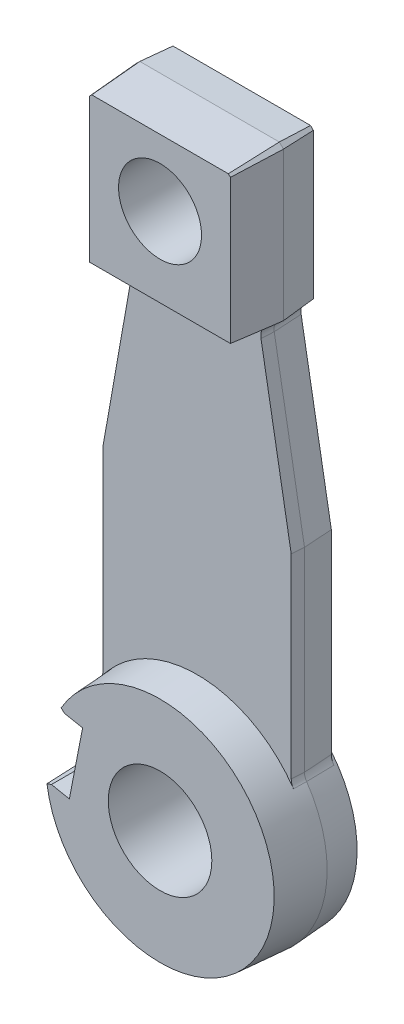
ISO-10303-21;
HEADER;
FILE_DESCRIPTION(('STEP AP214'),'2;1');
FILE_NAME('part.step','',(''),(''),'','','');
FILE_SCHEMA(('AUTOMOTIVE_DESIGN { 1 0 10303 214 1 1 1 1 }'));
ENDSEC;
DATA;
#1=APPLICATION_CONTEXT('core data for automotive mechanical design processes');
#2=APPLICATION_PROTOCOL_DEFINITION('international standard','automotive_design',2000,#1);
#3=PRODUCT_CONTEXT('',#1,'mechanical');
#4=PRODUCT('Part','Part','',(#3));
#5=PRODUCT_RELATED_PRODUCT_CATEGORY('part','',(#4));
#6=PRODUCT_DEFINITION_FORMATION('','',#4);
#7=PRODUCT_DEFINITION_CONTEXT('part definition',#1,'design');
#8=PRODUCT_DEFINITION('design','',#6,#7);
#9=PRODUCT_DEFINITION_SHAPE('','',#8);
#10=(LENGTH_UNIT() NAMED_UNIT(*) SI_UNIT(.MILLI.,.METRE.));
#11=(NAMED_UNIT(*) PLANE_ANGLE_UNIT() SI_UNIT($,.RADIAN.));
#12=(NAMED_UNIT(*) SI_UNIT($,.STERADIAN.) SOLID_ANGLE_UNIT());
#13=UNCERTAINTY_MEASURE_WITH_UNIT(LENGTH_MEASURE(1.E-05),#10,'distance_accuracy_value','');
#14=(GEOMETRIC_REPRESENTATION_CONTEXT(3) GLOBAL_UNCERTAINTY_ASSIGNED_CONTEXT((#13)) GLOBAL_UNIT_ASSIGNED_CONTEXT((#10,
#11,#12)) REPRESENTATION_CONTEXT('',''));
#15=CARTESIAN_POINT('',(0.,0.,0.));
#16=DIRECTION('',(0.,0.,1.));
#17=DIRECTION('',(1.,0.,0.));
#18=AXIS2_PLACEMENT_3D('',#15,#16,#17);
#19=CARTESIAN_POINT('',(-26.,17.7834192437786,-7.));
#20=DIRECTION('',(0.,0.,1.));
#21=DIRECTION('',(1.,0.,0.));
#22=AXIS2_PLACEMENT_3D('',#19,#20,#21);
#23=PLANE('',#22);
#24=DIRECTION('',(-1.,0.,0.));
#25=VECTOR('',#24,1.);
#26=CARTESIAN_POINT('',(-17.4105123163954,110.360258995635,-7.));
#27=LINE('',#26,#25);
#28=CARTESIAN_POINT('',(17.4105123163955,110.360258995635,-7.));
#29=VERTEX_POINT('',#28);
#30=CARTESIAN_POINT('',(-17.4105123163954,110.360258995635,-7.));
#31=VERTEX_POINT('',#30);
#32=EDGE_CURVE('E339',#29,#31,#27,.T.);
#33=ORIENTED_EDGE('',*,*,#32,.F.);
#34=CARTESIAN_POINT('',(18.6248728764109,107.08889036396,-7.));
#35=DIRECTION('',(0.,0.,1.));
#36=DIRECTION('',(1.,0.,0.));
#37=AXIS2_PLACEMENT_3D('',#34,#35,#36);
#38=CIRCLE('',#37,3.48948768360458);
#39=CARTESIAN_POINT('',(15.1883983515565,106.482947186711,-7.));
#40=VERTEX_POINT('',#39);
#41=EDGE_CURVE('E646',#40,#29,#38,.F.);
#42=ORIENTED_EDGE('',*,*,#41,.F.);
#43=DIRECTION('',(-0.173648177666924,0.984807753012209,0.));
#44=VECTOR('',#43,1.);
#45=CARTESIAN_POINT('',(29.1149288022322,27.501668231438,-7.));
#46=LINE('',#45,#44);
#47=CARTESIAN_POINT('',(22.5105123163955,64.9571753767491,-7.));
#48=VERTEX_POINT('',#47);
#49=EDGE_CURVE('E644',#48,#40,#46,.T.);
#50=ORIENTED_EDGE('',*,*,#49,.F.);
#51=DIRECTION('',(0.,1.,0.));
#52=VECTOR('',#51,1.);
#53=CARTESIAN_POINT('',(22.5105123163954,17.7834192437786,-7.));
#54=LINE('',#53,#52);
#55=CARTESIAN_POINT('',(22.5105123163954,17.7834192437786,-7.));
#56=VERTEX_POINT('',#55);
#57=EDGE_CURVE('E309',#56,#48,#54,.T.);
#58=ORIENTED_EDGE('',*,*,#57,.F.);
#59=CARTESIAN_POINT('',(26.,17.7834192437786,-7.));
#60=DIRECTION('',(0.,0.,1.));
#61=DIRECTION('',(1.,0.,0.));
#62=AXIS2_PLACEMENT_3D('',#59,#60,#61);
#63=CIRCLE('',#62,3.48948768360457);
#64=CARTESIAN_POINT('',(23.1197879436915,15.8134185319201,-7.));
#65=VERTEX_POINT('',#64);
#66=EDGE_CURVE('E306',#65,#56,#63,.F.);
#67=ORIENTED_EDGE('',*,*,#66,.F.);
#68=CARTESIAN_POINT('',(0.,0.,-7.));
#69=DIRECTION('',(0.,0.,-1.));
#70=DIRECTION('',(-1.,0.,0.));
#71=AXIS2_PLACEMENT_3D('',#68,#69,#70);
#72=CIRCLE('',#71,28.0105123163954);
#73=CARTESIAN_POINT('',(-23.1197879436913,15.8134185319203,-7.));
#74=VERTEX_POINT('',#73);
#75=EDGE_CURVE('E80',#74,#65,#72,.T.);
#76=ORIENTED_EDGE('',*,*,#75,.F.);
#77=CARTESIAN_POINT('',(-26.,17.7834192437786,-7.));
#78=DIRECTION('',(0.,0.,1.));
#79=DIRECTION('',(1.,0.,0.));
#80=AXIS2_PLACEMENT_3D('',#77,#78,#79);
#81=CIRCLE('',#80,3.48948768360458);
#82=CARTESIAN_POINT('',(-22.5105123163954,17.7834192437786,-7.));
#83=VERTEX_POINT('',#82);
#84=EDGE_CURVE('E310',#83,#74,#81,.F.);
#85=ORIENTED_EDGE('',*,*,#84,.F.);
#86=DIRECTION('',(0.,-1.,0.));
#87=VECTOR('',#86,1.);
#88=CARTESIAN_POINT('',(-22.5105123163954,17.7834192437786,-7.));
#89=LINE('',#88,#87);
#90=CARTESIAN_POINT('',(-22.5105123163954,64.9571753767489,-7.));
#91=VERTEX_POINT('',#90);
#92=EDGE_CURVE('E314',#91,#83,#89,.T.);
#93=ORIENTED_EDGE('',*,*,#92,.F.);
#94=DIRECTION('',(-0.173648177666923,-0.984807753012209,0.));
#95=VECTOR('',#94,1.);
#96=CARTESIAN_POINT('',(-30.6829206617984,18.6091445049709,-7.));
#97=LINE('',#96,#95);
#98=CARTESIAN_POINT('',(-15.1883983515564,106.482947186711,-7.));
#99=VERTEX_POINT('',#98);
#100=EDGE_CURVE('E653',#99,#91,#97,.T.);
#101=ORIENTED_EDGE('',*,*,#100,.F.);
#102=CARTESIAN_POINT('',(-18.6248728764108,107.08889036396,-7.));
#103=DIRECTION('',(0.,0.,1.));
#104=DIRECTION('',(1.,0.,0.));
#105=AXIS2_PLACEMENT_3D('',#102,#103,#104);
#106=CIRCLE('',#105,3.48948768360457);
#107=EDGE_CURVE('E651',#31,#99,#106,.F.);
#108=ORIENTED_EDGE('',*,*,#107,.F.);
#109=EDGE_LOOP('',(#33,#42,#50,#58,#67,#76,#85,#93,#101,#108));
#110=FACE_BOUND('',#109,.T.);
#111=ADVANCED_FACE('F31',(#110),#23,.F.);
#112=CARTESIAN_POINT('',(-26.,17.7834192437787,3.));
#113=DIRECTION('',(0.,0.,1.));
#114=DIRECTION('',(1.,0.,0.));
#115=AXIS2_PLACEMENT_3D('',#112,#113,#114);
#116=PLANE('',#115);
#117=CARTESIAN_POINT('',(18.6248728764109,107.08889036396,3.));
#118=DIRECTION('',(0.,0.,1.));
#119=DIRECTION('',(1.,0.,0.));
#120=AXIS2_PLACEMENT_3D('',#117,#118,#119);
#121=CIRCLE('',#120,3.20978043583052);
#122=CARTESIAN_POINT('',(15.4638562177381,106.531517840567,3.));
#123=VERTEX_POINT('',#122);
#124=CARTESIAN_POINT('',(17.6902195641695,110.159576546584,3.));
#125=VERTEX_POINT('',#124);
#126=EDGE_CURVE('E609',#123,#125,#121,.F.);
#127=ORIENTED_EDGE('',*,*,#126,.T.);
#128=DIRECTION('',(1.,0.,0.));
#129=VECTOR('',#128,1.);
#130=CARTESIAN_POINT('',(17.6902195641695,110.159576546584,3.));
#131=LINE('',#130,#129);
#132=CARTESIAN_POINT('',(-17.6902195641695,110.159576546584,3.));
#133=VERTEX_POINT('',#132);
#134=EDGE_CURVE('E283',#133,#125,#131,.T.);
#135=ORIENTED_EDGE('',*,*,#134,.F.);
#136=CARTESIAN_POINT('',(-18.6248728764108,107.08889036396,3.));
#137=DIRECTION('',(0.,0.,1.));
#138=DIRECTION('',(1.,0.,0.));
#139=AXIS2_PLACEMENT_3D('',#136,#137,#138);
#140=CIRCLE('',#139,3.20978043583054);
#141=CARTESIAN_POINT('',(-15.463856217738,106.531517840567,3.));
#142=VERTEX_POINT('',#141);
#143=EDGE_CURVE('E611',#133,#142,#140,.F.);
#144=ORIENTED_EDGE('',*,*,#143,.T.);
#145=DIRECTION('',(0.173648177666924,0.984807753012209,0.));
#146=VECTOR('',#145,1.);
#147=CARTESIAN_POINT('',(-15.463856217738,106.531517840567,3.));
#148=LINE('',#147,#146);
#149=CARTESIAN_POINT('',(-22.7902195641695,64.9816465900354,3.));
#150=VERTEX_POINT('',#149);
#151=EDGE_CURVE('E598',#142,#150,#148,.F.);
#152=ORIENTED_EDGE('',*,*,#151,.T.);
#153=DIRECTION('',(0.,1.,0.));
#154=VECTOR('',#153,1.);
#155=CARTESIAN_POINT('',(-22.7902195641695,65.0000000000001,3.));
#156=LINE('',#155,#154);
#157=CARTESIAN_POINT('',(-22.7902195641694,17.7834192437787,3.));
#158=VERTEX_POINT('',#157);
#159=EDGE_CURVE('E601',#150,#158,#156,.F.);
#160=ORIENTED_EDGE('',*,*,#159,.T.);
#161=CARTESIAN_POINT('',(-26.,17.7834192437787,3.));
#162=DIRECTION('',(0.,0.,1.));
#163=DIRECTION('',(1.,0.,0.));
#164=AXIS2_PLACEMENT_3D('',#161,#162,#163);
#165=CIRCLE('',#164,3.20978043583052);
#166=CARTESIAN_POINT('',(-23.3506574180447,15.9713280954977,3.));
#167=VERTEX_POINT('',#166);
#168=EDGE_CURVE('E604',#158,#167,#165,.F.);
#169=ORIENTED_EDGE('',*,*,#168,.T.);
#170=CARTESIAN_POINT('',(0.,0.,3.));
#171=DIRECTION('',(0.,0.,1.));
#172=DIRECTION('',(1.,0.,0.));
#173=AXIS2_PLACEMENT_3D('',#170,#171,#172);
#174=CIRCLE('',#173,28.2902195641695);
#175=CARTESIAN_POINT('',(23.3506574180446,15.9713280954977,3.));
#176=VERTEX_POINT('',#175);
#177=EDGE_CURVE('E663',#176,#167,#174,.T.);
#178=ORIENTED_EDGE('',*,*,#177,.F.);
#179=CARTESIAN_POINT('',(26.0000000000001,17.7834192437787,3.));
#180=DIRECTION('',(0.,0.,1.));
#181=DIRECTION('',(1.,0.,0.));
#182=AXIS2_PLACEMENT_3D('',#179,#180,#181);
#183=CIRCLE('',#182,3.20978043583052);
#184=CARTESIAN_POINT('',(22.7902195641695,17.7834192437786,3.));
#185=VERTEX_POINT('',#184);
#186=EDGE_CURVE('E607',#176,#185,#183,.F.);
#187=ORIENTED_EDGE('',*,*,#186,.T.);
#188=DIRECTION('',(0.,-1.,0.));
#189=VECTOR('',#188,1.);
#190=CARTESIAN_POINT('',(22.7902195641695,17.7834192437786,3.));
#191=LINE('',#190,#189);
#192=CARTESIAN_POINT('',(22.7902195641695,64.9816465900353,3.));
#193=VERTEX_POINT('',#192);
#194=EDGE_CURVE('E605',#185,#193,#191,.F.);
#195=ORIENTED_EDGE('',*,*,#194,.T.);
#196=DIRECTION('',(0.173648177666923,-0.984807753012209,0.));
#197=VECTOR('',#196,1.);
#198=CARTESIAN_POINT('',(22.7934066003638,64.9635720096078,3.));
#199=LINE('',#198,#197);
#200=EDGE_CURVE('E589',#193,#123,#199,.F.);
#201=ORIENTED_EDGE('',*,*,#200,.T.);
#202=EDGE_LOOP('',(#127,#135,#144,#152,#160,#169,#178,#187,#195,#201));
#203=FACE_BOUND('',#202,.T.);
#204=ADVANCED_FACE('F423',(#203),#116,.T.);
#205=CARTESIAN_POINT('',(-26.0000000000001,17.7834192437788,0.));
#206=DIRECTION('',(0.,0.,-1.));
#207=DIRECTION('',(1.,0.,0.));
#208=AXIS2_PLACEMENT_3D('',#205,#206,#207);
#209=CONICAL_SURFACE('',#208,3.,0.0698131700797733);
#210=CARTESIAN_POINT('',(-26.0000000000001,17.7834192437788,0.));
#211=DIRECTION('',(0.,0.,-1.));
#212=DIRECTION('',(1.,0.,0.));
#213=AXIS2_PLACEMENT_3D('',#210,#211,#212);
#214=CIRCLE('',#213,3.);
#215=CARTESIAN_POINT('',(-23.,17.7834192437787,0.));
#216=VERTEX_POINT('',#215);
#217=CARTESIAN_POINT('',(-23.5238095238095,16.0897602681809,0.));
#218=VERTEX_POINT('',#217);
#219=EDGE_CURVE('E614',#216,#218,#214,.T.);
#220=ORIENTED_EDGE('',*,*,#219,.F.);
#221=DIRECTION('',(-0.0697564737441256,0.,0.997564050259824));
#222=VECTOR('',#221,1.);
#223=CARTESIAN_POINT('',(-23.,17.7834192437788,0.));
#224=LINE('',#223,#222);
#225=EDGE_CURVE('E55',#83,#216,#224,.T.);
#226=ORIENTED_EDGE('',*,*,#225,.F.);
#227=ORIENTED_EDGE('',*,*,#84,.T.);
#228=DIRECTION('',(-0.0575767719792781,0.0393812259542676,0.997564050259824));
#229=VECTOR('',#228,1.);
#230=CARTESIAN_POINT('',(-23.5238095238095,16.0897602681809,0.));
#231=LINE('',#230,#229);
#232=EDGE_CURVE('E303',#74,#218,#231,.T.);
#233=ORIENTED_EDGE('',*,*,#232,.T.);
#234=EDGE_LOOP('',(#220,#226,#227,#233));
#235=FACE_BOUND('',#234,.T.);
#236=ADVANCED_FACE('F420',(#235),#209,.F.);
#237=CARTESIAN_POINT('',(-23.,17.7834192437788,0.));
#238=DIRECTION('',(-0.997564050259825,0.,-0.0697564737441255));
#239=DIRECTION('',(-0.0697564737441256,0.,0.997564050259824));
#240=AXIS2_PLACEMENT_3D('',#237,#238,#239);
#241=PLANE('',#240);
#242=DIRECTION('',(0.,-1.,0.));
#243=VECTOR('',#242,1.);
#244=CARTESIAN_POINT('',(-23.,17.7834192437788,0.));
#245=LINE('',#244,#243);
#246=CARTESIAN_POINT('',(-23.,65.,0.));
#247=VERTEX_POINT('',#246);
#248=EDGE_CURVE('E318',#247,#216,#245,.T.);
#249=ORIENTED_EDGE('',*,*,#248,.F.);
#250=DIRECTION('',(-0.0697551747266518,0.00610278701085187,0.997545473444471));
#251=VECTOR('',#250,1.);
#252=CARTESIAN_POINT('',(-22.9820315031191,64.9984279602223,-0.256961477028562));
#253=LINE('',#252,#251);
#254=EDGE_CURVE('E87',#91,#247,#253,.T.);
#255=ORIENTED_EDGE('',*,*,#254,.F.);
#256=ORIENTED_EDGE('',*,*,#92,.T.);
#257=ORIENTED_EDGE('',*,*,#225,.T.);
#258=EDGE_LOOP('',(#249,#255,#256,#257));
#259=FACE_BOUND('',#258,.T.);
#260=ADVANCED_FACE('F33',(#259),#241,.T.);
#261=CARTESIAN_POINT('',(-15.6704496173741,106.567945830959,0.));
#262=DIRECTION('',(-0.982408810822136,0.173225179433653,-0.0697564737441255));
#263=DIRECTION('',(-0.173648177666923,-0.984807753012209,0.));
#264=AXIS2_PLACEMENT_3D('',#261,#262,#263);
#265=PLANE('',#264);
#266=DIRECTION('',(-0.173648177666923,-0.984807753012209,0.));
#267=VECTOR('',#266,1.);
#268=CARTESIAN_POINT('',(-15.6704496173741,106.567945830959,0.));
#269=LINE('',#268,#267);
#270=CARTESIAN_POINT('',(-15.6704496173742,106.567945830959,0.));
#271=VERTEX_POINT('',#270);
#272=EDGE_CURVE('E633',#271,#247,#269,.T.);
#273=ORIENTED_EDGE('',*,*,#272,.F.);
#274=DIRECTION('',(-0.0686967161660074,0.0121130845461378,0.997564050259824));
#275=VECTOR('',#274,1.);
#276=CARTESIAN_POINT('',(-15.6704496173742,106.567945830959,0.));
#277=LINE('',#276,#275);
#278=EDGE_CURVE('E94',#99,#271,#277,.T.);
#279=ORIENTED_EDGE('',*,*,#278,.F.);
#280=ORIENTED_EDGE('',*,*,#100,.T.);
#281=ORIENTED_EDGE('',*,*,#254,.T.);
#282=EDGE_LOOP('',(#273,#279,#280,#281));
#283=FACE_BOUND('',#282,.T.);
#284=ADVANCED_FACE('F419',(#283),#265,.T.);
#285=CARTESIAN_POINT('',(-18.6248728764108,107.08889036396,0.));
#286=DIRECTION('',(0.,0.,-1.));
#287=DIRECTION('',(-1.,0.,0.));
#288=AXIS2_PLACEMENT_3D('',#285,#286,#287);
#289=CONICAL_SURFACE('',#288,3.,0.0698131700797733);
#290=CARTESIAN_POINT('',(-18.6248728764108,107.08889036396,0.));
#291=DIRECTION('',(0.,0.,-1.));
#292=DIRECTION('',(-1.,0.,0.));
#293=AXIS2_PLACEMENT_3D('',#290,#291,#292);
#294=CIRCLE('',#293,3.);
#295=CARTESIAN_POINT('',(-17.9,110.,0.));
#296=VERTEX_POINT('',#295);
#297=EDGE_CURVE('E630',#296,#271,#294,.T.);
#298=ORIENTED_EDGE('',*,*,#297,.F.);
#299=CARTESIAN_POINT('',(-17.4105123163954,110.360258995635,-7.));
#300=CARTESIAN_POINT('',(-17.4513087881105,110.331884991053,-6.4165832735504));
#301=CARTESIAN_POINT('',(-17.4921040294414,110.303145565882,-5.83318414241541));
#302=CARTESIAN_POINT('',(-17.5736916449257,110.244868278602,-4.66642688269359));
#303=CARTESIAN_POINT('',(-17.6144840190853,110.215330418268,-4.08306875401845));
#304=CARTESIAN_POINT('',(-17.6960656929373,110.155388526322,-2.91639646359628));
#305=CARTESIAN_POINT('',(-17.7368549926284,110.124984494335,-2.33308230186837));
#306=CARTESIAN_POINT('',(-17.8184301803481,110.063226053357,-1.16650276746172));
#307=CARTESIAN_POINT('',(-17.8592160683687,110.031871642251,-0.583237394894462));
#308=CARTESIAN_POINT('',(-17.9,110.,0.));
#309=B_SPLINE_CURVE_WITH_KNOTS('',3,(#299,#300,#301,#302,#303,#304,#305,#306,#307,#308),
.UNSPECIFIED.,.F.,.F.,(4,2,2,2,4),(0.,1.75658779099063,3.51317167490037,5.26975631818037,
7.0263448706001),.UNSPECIFIED.);
#310=EDGE_CURVE('E404',#31,#296,#309,.T.);
#311=ORIENTED_EDGE('',*,*,#310,.F.);
#312=ORIENTED_EDGE('',*,*,#107,.T.);
#313=ORIENTED_EDGE('',*,*,#278,.T.);
#314=EDGE_LOOP('',(#298,#311,#312,#313));
#315=FACE_BOUND('',#314,.T.);
#316=ADVANCED_FACE('F415',(#315),#289,.F.);
#317=CARTESIAN_POINT('',(-17.8999999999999,146.,0.));
#318=DIRECTION('',(-0.997564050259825,0.,-0.0697564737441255));
#319=DIRECTION('',(-0.0697564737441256,0.,0.997564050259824));
#320=AXIS2_PLACEMENT_3D('',#317,#318,#319);
#321=PLANE('',#320);
#322=DIRECTION('',(0.,-1.,0.));
#323=VECTOR('',#322,1.);
#324=CARTESIAN_POINT('',(-17.8999999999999,146.,0.));
#325=LINE('',#324,#323);
#326=CARTESIAN_POINT('',(-17.8999999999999,146.,0.));
#327=VERTEX_POINT('',#326);
#328=EDGE_CURVE('E627',#327,#296,#325,.T.);
#329=ORIENTED_EDGE('',*,*,#328,.F.);
#330=DIRECTION('',(-0.0697273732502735,0.0288820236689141,0.997147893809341));
#331=VECTOR('',#330,1.);
#332=CARTESIAN_POINT('',(-17.8999999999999,146.,0.));
#333=LINE('',#332,#331);
#334=CARTESIAN_POINT('',(-17.3545708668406,145.774075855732,-7.8));
#335=VERTEX_POINT('',#334);
#336=EDGE_CURVE('E367',#335,#327,#333,.T.);
#337=ORIENTED_EDGE('',*,*,#336,.F.);
#338=DIRECTION('',(0.,-1.,0.));
#339=VECTOR('',#338,1.);
#340=CARTESIAN_POINT('',(-17.3545708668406,145.797247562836,-7.8));
#341=LINE('',#340,#339);
#342=CARTESIAN_POINT('',(-17.3545708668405,110.41620044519,-7.8));
#343=VERTEX_POINT('',#342);
#344=EDGE_CURVE('E291',#343,#335,#341,.F.);
#345=ORIENTED_EDGE('',*,*,#344,.F.);
#346=DIRECTION('',(-0.0695873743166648,-0.0695873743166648,0.995145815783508));
#347=VECTOR('',#346,1.);
#348=CARTESIAN_POINT('',(-17.2389121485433,110.531859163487,-9.45399673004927));
#349=LINE('',#348,#347);
#350=EDGE_CURVE('E342',#343,#31,#349,.T.);
#351=ORIENTED_EDGE('',*,*,#350,.T.);
#352=ORIENTED_EDGE('',*,*,#310,.T.);
#353=EDGE_LOOP('',(#329,#337,#345,#351,#352));
#354=FACE_BOUND('',#353,.T.);
#355=ADVANCED_FACE('F413',(#354),#321,.T.);
#356=CARTESIAN_POINT('',(-17.8999999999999,146.,0.));
#357=DIRECTION('',(-0.705384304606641,0.705384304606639,-0.0697564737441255));
#358=DIRECTION('',(-0.707106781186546,-0.707106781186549,0.));
#359=AXIS2_PLACEMENT_3D('',#356,#357,#358);
#360=PLANE('',#359);
#361=DIRECTION('',(-0.707106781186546,-0.707106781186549,0.));
#362=VECTOR('',#361,1.);
#363=CARTESIAN_POINT('',(-17.8999999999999,146.,0.));
#364=LINE('',#363,#362);
#365=CARTESIAN_POINT('',(-16.9,147.,0.));
#366=VERTEX_POINT('',#365);
#367=EDGE_CURVE('E372',#366,#327,#364,.T.);
#368=ORIENTED_EDGE('',*,*,#367,.F.);
#369=DIRECTION('',(-0.0288820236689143,0.0697273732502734,0.997147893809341));
#370=VECTOR('',#369,1.);
#371=CARTESIAN_POINT('',(-16.9,147.,0.));
#372=LINE('',#371,#370);
#373=CARTESIAN_POINT('',(-16.674075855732,146.454570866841,-7.8));
#374=VERTEX_POINT('',#373);
#375=EDGE_CURVE('E369',#374,#366,#372,.T.);
#376=ORIENTED_EDGE('',*,*,#375,.F.);
#377=DIRECTION('',(-0.707106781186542,-0.707106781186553,0.));
#378=VECTOR('',#377,1.);
#379=CARTESIAN_POINT('',(-16.6576909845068,146.470955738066,-7.8));
#380=LINE('',#379,#378);
#381=EDGE_CURVE('E341',#335,#374,#380,.F.);
#382=ORIENTED_EDGE('',*,*,#381,.F.);
#383=ORIENTED_EDGE('',*,*,#336,.T.);
#384=EDGE_LOOP('',(#368,#376,#382,#383));
#385=FACE_BOUND('',#384,.T.);
#386=ADVANCED_FACE('F366',(#385),#360,.T.);
#387=CARTESIAN_POINT('',(-16.9,147.,0.));
#388=DIRECTION('',(0.,0.997564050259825,-0.0697564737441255));
#389=DIRECTION('',(0.,0.0697564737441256,0.997564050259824));
#390=AXIS2_PLACEMENT_3D('',#387,#388,#389);
#391=PLANE('',#390);
#392=DIRECTION('',(-1.,0.,0.));
#393=VECTOR('',#392,1.);
#394=CARTESIAN_POINT('',(-16.9,147.,0.));
#395=LINE('',#394,#393);
#396=CARTESIAN_POINT('',(16.9,147.,0.));
#397=VERTEX_POINT('',#396);
#398=EDGE_CURVE('E624',#397,#366,#395,.T.);
#399=ORIENTED_EDGE('',*,*,#398,.F.);
#400=DIRECTION('',(0.0288820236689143,0.0697273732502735,0.997147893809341));
#401=VECTOR('',#400,1.);
#402=CARTESIAN_POINT('',(16.8988203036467,146.997151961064,-0.0407288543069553));
#403=LINE('',#402,#401);
#404=CARTESIAN_POINT('',(16.674075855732,146.454570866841,-7.8));
#405=VERTEX_POINT('',#404);
#406=EDGE_CURVE('E376',#405,#397,#403,.T.);
#407=ORIENTED_EDGE('',*,*,#406,.F.);
#408=DIRECTION('',(-1.,0.,0.));
#409=VECTOR('',#408,1.);
#410=CARTESIAN_POINT('',(16.6972475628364,146.454570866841,-7.8));
#411=LINE('',#410,#409);
#412=EDGE_CURVE('E348',#374,#405,#411,.F.);
#413=ORIENTED_EDGE('',*,*,#412,.F.);
#414=ORIENTED_EDGE('',*,*,#375,.T.);
#415=EDGE_LOOP('',(#399,#407,#413,#414));
#416=FACE_BOUND('',#415,.T.);
#417=ADVANCED_FACE('F378',(#416),#391,.T.);
#418=CARTESIAN_POINT('',(17.9,146.,0.));
#419=DIRECTION('',(0.705384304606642,0.705384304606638,-0.0697564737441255));
#420=DIRECTION('',(-0.707106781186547,0.707106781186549,0.));
#421=AXIS2_PLACEMENT_3D('',#418,#419,#420);
#422=PLANE('',#421);
#423=DIRECTION('',(-0.707106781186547,0.707106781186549,0.));
#424=VECTOR('',#423,1.);
#425=CARTESIAN_POINT('',(17.9,146.,0.));
#426=LINE('',#425,#424);
#427=CARTESIAN_POINT('',(17.9,146.,0.));
#428=VERTEX_POINT('',#427);
#429=EDGE_CURVE('E386',#428,#397,#426,.T.);
#430=ORIENTED_EDGE('',*,*,#429,.F.);
#431=DIRECTION('',(0.0697273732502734,0.0288820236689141,0.997147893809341));
#432=VECTOR('',#431,1.);
#433=CARTESIAN_POINT('',(17.9,146.,0.));
#434=LINE('',#433,#432);
#435=CARTESIAN_POINT('',(17.3545708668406,145.774075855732,-7.8));
#436=VERTEX_POINT('',#435);
#437=EDGE_CURVE('E384',#436,#428,#434,.T.);
#438=ORIENTED_EDGE('',*,*,#437,.F.);
#439=DIRECTION('',(-0.707106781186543,0.707106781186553,0.));
#440=VECTOR('',#439,1.);
#441=CARTESIAN_POINT('',(17.3709557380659,145.757690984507,-7.8));
#442=LINE('',#441,#440);
#443=EDGE_CURVE('E351',#405,#436,#442,.F.);
#444=ORIENTED_EDGE('',*,*,#443,.F.);
#445=ORIENTED_EDGE('',*,*,#406,.T.);
#446=EDGE_LOOP('',(#430,#438,#444,#445));
#447=FACE_BOUND('',#446,.T.);
#448=ADVANCED_FACE('F383',(#447),#422,.T.);
#449=CARTESIAN_POINT('',(17.9,146.,0.));
#450=DIRECTION('',(0.997564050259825,0.,-0.0697564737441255));
#451=DIRECTION('',(-0.0697564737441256,0.,-0.997564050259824));
#452=AXIS2_PLACEMENT_3D('',#449,#450,#451);
#453=PLANE('',#452);
#454=DIRECTION('',(0.,1.,0.));
#455=VECTOR('',#454,1.);
#456=CARTESIAN_POINT('',(17.9,146.,0.));
#457=LINE('',#456,#455);
#458=CARTESIAN_POINT('',(17.9,110.,0.));
#459=VERTEX_POINT('',#458);
#460=EDGE_CURVE('E504',#459,#428,#457,.T.);
#461=ORIENTED_EDGE('',*,*,#460,.F.);
#462=CARTESIAN_POINT('',(17.4105123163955,110.360258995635,-7.));
#463=CARTESIAN_POINT('',(17.4513087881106,110.331884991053,-6.4165832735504));
#464=CARTESIAN_POINT('',(17.4921040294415,110.303145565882,-5.8331841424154));
#465=CARTESIAN_POINT('',(17.5736916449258,110.244868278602,-4.66642688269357));
#466=CARTESIAN_POINT('',(17.6144840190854,110.215330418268,-4.08306875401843));
#467=CARTESIAN_POINT('',(17.6960656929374,110.155388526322,-2.91639646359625));
#468=CARTESIAN_POINT('',(17.7368549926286,110.124984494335,-2.33308230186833));
#469=CARTESIAN_POINT('',(17.8184301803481,110.063226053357,-1.16650276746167));
#470=CARTESIAN_POINT('',(17.8592160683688,110.031871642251,-0.583237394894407));
#471=CARTESIAN_POINT('',(17.9,110.,0.));
#472=B_SPLINE_CURVE_WITH_KNOTS('',3,(#462,#463,#464,#465,#466,#467,#468,#469,#470,#471),
.UNSPECIFIED.,.F.,.F.,(4,2,2,2,4),(0.,1.75658779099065,3.51317167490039,5.26975631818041,
7.02634487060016),.UNSPECIFIED.);
#473=EDGE_CURVE('E390',#29,#459,#472,.T.);
#474=ORIENTED_EDGE('',*,*,#473,.F.);
#475=DIRECTION('',(0.0695873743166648,-0.0695873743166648,0.995145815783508));
#476=VECTOR('',#475,1.);
#477=CARTESIAN_POINT('',(17.2418948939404,110.52887641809,-9.41134148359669));
#478=LINE('',#477,#476);
#479=CARTESIAN_POINT('',(17.3545708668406,110.41620044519,-7.8));
#480=VERTEX_POINT('',#479);
#481=EDGE_CURVE('E288',#480,#29,#478,.T.);
#482=ORIENTED_EDGE('',*,*,#481,.F.);
#483=DIRECTION('',(0.,1.,0.));
#484=VECTOR('',#483,1.);
#485=CARTESIAN_POINT('',(17.3545708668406,110.360258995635,-7.8));
#486=LINE('',#485,#484);
#487=EDGE_CURVE('E354',#436,#480,#486,.F.);
#488=ORIENTED_EDGE('',*,*,#487,.F.);
#489=ORIENTED_EDGE('',*,*,#437,.T.);
#490=EDGE_LOOP('',(#461,#474,#482,#488,#489));
#491=FACE_BOUND('',#490,.T.);
#492=ADVANCED_FACE('F495',(#491),#453,.T.);
#493=CARTESIAN_POINT('',(18.6248728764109,107.08889036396,0.));
#494=DIRECTION('',(0.,0.,-1.));
#495=DIRECTION('',(1.,0.,0.));
#496=AXIS2_PLACEMENT_3D('',#493,#494,#495);
#497=CONICAL_SURFACE('',#496,3.,0.0698131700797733);
#498=CARTESIAN_POINT('',(18.6248728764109,107.08889036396,0.));
#499=DIRECTION('',(0.,0.,-1.));
#500=DIRECTION('',(1.,0.,0.));
#501=AXIS2_PLACEMENT_3D('',#498,#499,#500);
#502=CIRCLE('',#501,3.);
#503=CARTESIAN_POINT('',(15.6704496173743,106.567945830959,0.));
#504=VERTEX_POINT('',#503);
#505=EDGE_CURVE('E511',#504,#459,#502,.T.);
#506=ORIENTED_EDGE('',*,*,#505,.F.);
#507=DIRECTION('',(0.0686967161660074,0.012113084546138,0.997564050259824));
#508=VECTOR('',#507,1.);
#509=CARTESIAN_POINT('',(15.6704496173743,106.567945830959,0.));
#510=LINE('',#509,#508);
#511=EDGE_CURVE('E393',#40,#504,#510,.T.);
#512=ORIENTED_EDGE('',*,*,#511,.F.);
#513=ORIENTED_EDGE('',*,*,#41,.T.);
#514=ORIENTED_EDGE('',*,*,#473,.T.);
#515=EDGE_LOOP('',(#506,#512,#513,#514));
#516=FACE_BOUND('',#515,.T.);
#517=ADVANCED_FACE('F491',(#516),#497,.F.);
#518=CARTESIAN_POINT('',(15.6704496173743,106.567945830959,0.));
#519=DIRECTION('',(0.982408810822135,0.173225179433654,-0.0697564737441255));
#520=DIRECTION('',(-0.173648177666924,0.984807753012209,0.));
#521=AXIS2_PLACEMENT_3D('',#518,#519,#520);
#522=PLANE('',#521);
#523=DIRECTION('',(-0.173648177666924,0.984807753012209,0.));
#524=VECTOR('',#523,1.);
#525=CARTESIAN_POINT('',(15.6704496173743,106.567945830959,0.));
#526=LINE('',#525,#524);
#527=CARTESIAN_POINT('',(23.,65.0000000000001,0.));
#528=VERTEX_POINT('',#527);
#529=EDGE_CURVE('E524',#528,#504,#526,.T.);
#530=ORIENTED_EDGE('',*,*,#529,.F.);
#531=DIRECTION('',(0.0697551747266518,0.00610278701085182,0.997545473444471));
#532=VECTOR('',#531,1.);
#533=CARTESIAN_POINT('',(22.9798998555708,64.9982414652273,-0.287445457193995));
#534=LINE('',#533,#532);
#535=EDGE_CURVE('E640',#48,#528,#534,.T.);
#536=ORIENTED_EDGE('',*,*,#535,.F.);
#537=ORIENTED_EDGE('',*,*,#49,.T.);
#538=ORIENTED_EDGE('',*,*,#511,.T.);
#539=EDGE_LOOP('',(#530,#536,#537,#538));
#540=FACE_BOUND('',#539,.T.);
#541=ADVANCED_FACE('F494',(#540),#522,.T.);
#542=CARTESIAN_POINT('',(23.,17.7834192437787,0.));
#543=DIRECTION('',(0.997564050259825,0.,-0.0697564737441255));
#544=DIRECTION('',(-0.0697564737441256,0.,-0.997564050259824));
#545=AXIS2_PLACEMENT_3D('',#542,#543,#544);
#546=PLANE('',#545);
#547=DIRECTION('',(0.,1.,0.));
#548=VECTOR('',#547,1.);
#549=CARTESIAN_POINT('',(23.,17.7834192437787,0.));
#550=LINE('',#549,#548);
#551=CARTESIAN_POINT('',(23.,17.7834192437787,0.));
#552=VERTEX_POINT('',#551);
#553=EDGE_CURVE('E578',#552,#528,#550,.T.);
#554=ORIENTED_EDGE('',*,*,#553,.F.);
#555=DIRECTION('',(0.0697564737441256,0.,0.997564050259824));
#556=VECTOR('',#555,1.);
#557=CARTESIAN_POINT('',(23.,17.7834192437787,0.));
#558=LINE('',#557,#556);
#559=EDGE_CURVE('E302',#56,#552,#558,.T.);
#560=ORIENTED_EDGE('',*,*,#559,.F.);
#561=ORIENTED_EDGE('',*,*,#57,.T.);
#562=ORIENTED_EDGE('',*,*,#535,.T.);
#563=EDGE_LOOP('',(#554,#560,#561,#562));
#564=FACE_BOUND('',#563,.T.);
#565=ADVANCED_FACE('F813',(#564),#546,.T.);
#566=CARTESIAN_POINT('',(26.0000000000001,17.7834192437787,0.));
#567=DIRECTION('',(0.,0.,-1.));
#568=DIRECTION('',(-1.,0.,0.));
#569=AXIS2_PLACEMENT_3D('',#566,#567,#568);
#570=CONICAL_SURFACE('',#569,3.,0.0698131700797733);
#571=CARTESIAN_POINT('',(26.0000000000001,17.7834192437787,0.));
#572=DIRECTION('',(0.,0.,-1.));
#573=DIRECTION('',(-1.,0.,0.));
#574=AXIS2_PLACEMENT_3D('',#571,#572,#573);
#575=CIRCLE('',#574,3.);
#576=CARTESIAN_POINT('',(23.5238095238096,16.0897602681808,0.));
#577=VERTEX_POINT('',#576);
#578=EDGE_CURVE('E586',#577,#552,#575,.T.);
#579=ORIENTED_EDGE('',*,*,#578,.F.);
#580=DIRECTION('',(0.0575767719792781,0.0393812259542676,0.997564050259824));
#581=VECTOR('',#580,1.);
#582=CARTESIAN_POINT('',(23.5238095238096,16.0897602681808,0.));
#583=LINE('',#582,#581);
#584=EDGE_CURVE('E300',#65,#577,#583,.T.);
#585=ORIENTED_EDGE('',*,*,#584,.F.);
#586=ORIENTED_EDGE('',*,*,#66,.T.);
#587=ORIENTED_EDGE('',*,*,#559,.T.);
#588=EDGE_LOOP('',(#579,#585,#586,#587));
#589=FACE_BOUND('',#588,.T.);
#590=ADVANCED_FACE('F429',(#589),#570,.F.);
#591=CARTESIAN_POINT('',(0.,0.,0.));
#592=DIRECTION('',(0.,0.,1.));
#593=DIRECTION('',(1.,0.,0.));
#594=AXIS2_PLACEMENT_3D('',#591,#592,#593);
#595=CONICAL_SURFACE('',#594,28.5,0.0698131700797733);
#596=CARTESIAN_POINT('',(-27.6793747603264,-3.91273092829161,-7.8002));
#597=CARTESIAN_POINT('',(-27.7669264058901,-3.94287737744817,-6.50013149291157));
#598=CARTESIAN_POINT('',(-27.8544626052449,-3.97301850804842,-5.20006182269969));
#599=CARTESIAN_POINT('',(-28.0295041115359,-4.03329013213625,-2.59992015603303));
#600=CARTESIAN_POINT('',(-28.1170094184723,-4.06342062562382,-1.29984815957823));
#601=CARTESIAN_POINT('',(-28.2044992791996,-4.0935458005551,0.000224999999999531));
#602=B_SPLINE_CURVE_WITH_KNOTS('',3,(#596,#597,#598,#599,#600,#601),.UNSPECIFIED.,.F.,.F.,(4,2,
4),(0.,3.91008567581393,7.82017135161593),.UNSPECIFIED.);
#603=CARTESIAN_POINT('',(-27.6793882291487,-3.91273556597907,-7.8));
#604=VERTEX_POINT('',#603);
#605=CARTESIAN_POINT('',(-28.2044841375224,-4.09354058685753,1.04083408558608E-13));
#606=VERTEX_POINT('',#605);
#607=EDGE_CURVE('E440',#604,#606,#602,.T.);
#608=ORIENTED_EDGE('',*,*,#607,.F.);
#609=CARTESIAN_POINT('',(0.,0.,-7.8));
#610=DIRECTION('',(0.,0.,-1.));
#611=DIRECTION('',(-1.,0.,0.));
#612=AXIS2_PLACEMENT_3D('',#609,#610,#611);
#613=CIRCLE('',#612,27.9545708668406);
#614=CARTESIAN_POINT('',(-24.198145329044,13.9967065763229,-7.8));
#615=VERTEX_POINT('',#614);
#616=EDGE_CURVE('E282',#615,#604,#613,.T.);
#617=ORIENTED_EDGE('',*,*,#616,.F.);
#618=CARTESIAN_POINT('',(-24.6172871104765,14.3610609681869,0.000224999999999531));
#619=CARTESIAN_POINT('',(-24.5474530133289,14.3003551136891,-1.29984815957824));
#620=CARTESIAN_POINT('',(-24.4776065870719,14.2396385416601,-2.59992015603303));
#621=CARTESIAN_POINT('',(-24.337889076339,14.1181839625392,-5.2000618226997));
#622=CARTESIAN_POINT('',(-24.268017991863,14.0574459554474,-6.50013149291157));
#623=CARTESIAN_POINT('',(-24.1981345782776,13.9966972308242,-7.8002));
#624=B_SPLINE_CURVE_WITH_KNOTS('',3,(#618,#619,#620,#621,#622,#623),.UNSPECIFIED.,.F.,.F.,(4,2,
4),(0.,3.91008567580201,7.82017135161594),.UNSPECIFIED.);
#625=CARTESIAN_POINT('',(-24.6172750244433,14.3610504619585,1.11022302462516E-13));
#626=VERTEX_POINT('',#625);
#627=EDGE_CURVE('E46',#626,#615,#624,.T.);
#628=ORIENTED_EDGE('',*,*,#627,.F.);
#629=CARTESIAN_POINT('',(0.,0.,0.));
#630=DIRECTION('',(0.,0.,1.));
#631=DIRECTION('',(1.,0.,0.));
#632=AXIS2_PLACEMENT_3D('',#629,#630,#631);
#633=CIRCLE('',#632,28.5);
#634=EDGE_CURVE('E618',#218,#626,#633,.T.);
#635=ORIENTED_EDGE('',*,*,#634,.F.);
#636=ORIENTED_EDGE('',*,*,#232,.F.);
#637=ORIENTED_EDGE('',*,*,#75,.T.);
#638=ORIENTED_EDGE('',*,*,#584,.T.);
#639=EDGE_CURVE('E617',#606,#577,#633,.T.);
#640=ORIENTED_EDGE('',*,*,#639,.F.);
#641=EDGE_LOOP('',(#608,#617,#628,#635,#636,#637,#638,#640));
#642=FACE_BOUND('',#641,.T.);
#643=ADVANCED_FACE('F424',(#642),#595,.T.);
#644=CARTESIAN_POINT('',(-15.6704496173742,106.567945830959,0.));
#645=DIRECTION('',(-0.982408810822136,0.173225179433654,0.0697564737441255));
#646=DIRECTION('',(-0.173648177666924,-0.984807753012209,0.));
#647=AXIS2_PLACEMENT_3D('',#644,#645,#646);
#648=PLANE('',#647);
#649=ORIENTED_EDGE('',*,*,#272,.T.);
#650=DIRECTION('',(-0.0697551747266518,0.00610278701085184,-0.997545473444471));
#651=VECTOR('',#650,1.);
#652=CARTESIAN_POINT('',(-23.,65.0000000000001,0.));
#653=LINE('',#652,#651);
#654=EDGE_CURVE('E596',#150,#247,#653,.T.);
#655=ORIENTED_EDGE('',*,*,#654,.F.);
#656=ORIENTED_EDGE('',*,*,#151,.F.);
#657=DIRECTION('',(-0.0686967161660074,0.012113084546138,-0.997564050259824));
#658=VECTOR('',#657,1.);
#659=CARTESIAN_POINT('',(-15.6704496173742,106.567945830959,0.));
#660=LINE('',#659,#658);
#661=EDGE_CURVE('E613',#142,#271,#660,.T.);
#662=ORIENTED_EDGE('',*,*,#661,.T.);
#663=EDGE_LOOP('',(#649,#655,#656,#662));
#664=FACE_BOUND('',#663,.T.);
#665=ADVANCED_FACE('F428',(#664),#648,.T.);
#666=CARTESIAN_POINT('',(-23.,65.0000000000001,0.));
#667=DIRECTION('',(-0.997564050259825,0.,0.0697564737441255));
#668=DIRECTION('',(0.0697564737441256,0.,0.997564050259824));
#669=AXIS2_PLACEMENT_3D('',#666,#667,#668);
#670=PLANE('',#669);
#671=ORIENTED_EDGE('',*,*,#248,.T.);
#672=DIRECTION('',(-0.0697564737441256,0.,-0.997564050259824));
#673=VECTOR('',#672,1.);
#674=CARTESIAN_POINT('',(-23.,17.7834192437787,0.));
#675=LINE('',#674,#673);
#676=EDGE_CURVE('E593',#158,#216,#675,.T.);
#677=ORIENTED_EDGE('',*,*,#676,.F.);
#678=ORIENTED_EDGE('',*,*,#159,.F.);
#679=ORIENTED_EDGE('',*,*,#654,.T.);
#680=EDGE_LOOP('',(#671,#677,#678,#679));
#681=FACE_BOUND('',#680,.T.);
#682=ADVANCED_FACE('F484',(#681),#670,.T.);
#683=CARTESIAN_POINT('',(-26.,17.7834192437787,0.));
#684=DIRECTION('',(0.,0.,1.));
#685=DIRECTION('',(1.,0.,0.));
#686=AXIS2_PLACEMENT_3D('',#683,#684,#685);
#687=CONICAL_SURFACE('',#686,2.99999999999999,0.0698131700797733);
#688=ORIENTED_EDGE('',*,*,#219,.T.);
#689=DIRECTION('',(-0.0575767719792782,0.0393812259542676,-0.997564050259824));
#690=VECTOR('',#689,1.);
#691=CARTESIAN_POINT('',(-23.5238095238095,16.0897602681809,0.));
#692=LINE('',#691,#690);
#693=EDGE_CURVE('E597',#167,#218,#692,.T.);
#694=ORIENTED_EDGE('',*,*,#693,.F.);
#695=ORIENTED_EDGE('',*,*,#168,.F.);
#696=ORIENTED_EDGE('',*,*,#676,.T.);
#697=EDGE_LOOP('',(#688,#694,#695,#696));
#698=FACE_BOUND('',#697,.T.);
#699=ADVANCED_FACE('F478',(#698),#687,.F.);
#700=CARTESIAN_POINT('',(0.,0.,0.));
#701=DIRECTION('',(0.,0.,-1.));
#702=DIRECTION('',(1.,0.,0.));
#703=AXIS2_PLACEMENT_3D('',#700,#701,#702);
#704=CONICAL_SURFACE('',#703,28.5,0.0698131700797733);
#705=CARTESIAN_POINT('',(0.,0.,12.));
#706=DIRECTION('',(0.,0.,1.));
#707=DIRECTION('',(1.,0.,0.));
#708=AXIS2_PLACEMENT_3D('',#705,#706,#707);
#709=CIRCLE('',#708,27.6608782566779);
#710=CARTESIAN_POINT('',(-27.3964866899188,-3.81532475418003,12.));
#711=VERTEX_POINT('',#710);
#712=CARTESIAN_POINT('',(-23.9723343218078,13.8004120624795,12.));
#713=VERTEX_POINT('',#712);
#714=EDGE_CURVE('E602',#711,#713,#709,.T.);
#715=ORIENTED_EDGE('',*,*,#714,.F.);
#716=CARTESIAN_POINT('',(-27.3964732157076,-3.81532011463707,12.0002));
#717=CARTESIAN_POINT('',(-27.5312185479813,-3.86171665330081,10.0001347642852));
#718=CARTESIAN_POINT('',(-27.6659267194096,-3.90810039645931,8.00006672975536));
#719=CARTESIAN_POINT('',(-27.9352687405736,-4.00084229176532,3.99992506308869));
#720=CARTESIAN_POINT('',(-28.0699025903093,-4.04720044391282,1.99985143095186));
#721=CARTESIAN_POINT('',(-28.2044992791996,-4.0935458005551,-0.000224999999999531));
#722=B_SPLINE_CURVE_WITH_KNOTS('',3,(#716,#717,#718,#719,#720,#721),.UNSPECIFIED.,.F.,.F.,(4,2,
4),(0.,6.01540763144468,12.03081526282),.UNSPECIFIED.);
#723=EDGE_CURVE('E448',#711,#606,#722,.T.);
#724=ORIENTED_EDGE('',*,*,#723,.T.);
#725=ORIENTED_EDGE('',*,*,#639,.T.);
#726=DIRECTION('',(0.0575767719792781,0.0393812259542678,-0.997564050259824));
#727=VECTOR('',#726,1.);
#728=CARTESIAN_POINT('',(23.5238095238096,16.0897602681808,0.));
#729=LINE('',#728,#727);
#730=EDGE_CURVE('E590',#176,#577,#729,.T.);
#731=ORIENTED_EDGE('',*,*,#730,.F.);
#732=ORIENTED_EDGE('',*,*,#177,.T.);
#733=ORIENTED_EDGE('',*,*,#693,.T.);
#734=ORIENTED_EDGE('',*,*,#634,.T.);
#735=CARTESIAN_POINT('',(-24.6172871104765,14.3610609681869,-0.000224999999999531));
#736=CARTESIAN_POINT('',(-24.5098525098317,14.2676694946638,1.99985143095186));
#737=CARTESIAN_POINT('',(-24.4023882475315,14.1742522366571,3.99992506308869));
#738=CARTESIAN_POINT('',(-24.1874003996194,13.9873661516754,8.00006672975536));
#739=CARTESIAN_POINT('',(-24.0798768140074,13.8938973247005,10.0001347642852));
#740=CARTESIAN_POINT('',(-23.9723235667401,13.8004027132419,12.0002));
#741=B_SPLINE_CURVE_WITH_KNOTS('',3,(#735,#736,#737,#738,#739,#740),.UNSPECIFIED.,.F.,.F.,(4,2,
4),(0.,6.01540763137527,12.0308152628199),.UNSPECIFIED.);
#742=EDGE_CURVE('E466',#626,#713,#741,.T.);
#743=ORIENTED_EDGE('',*,*,#742,.T.);
#744=EDGE_LOOP('',(#715,#724,#725,#731,#732,#733,#734,#743));
#745=FACE_BOUND('',#744,.T.);
#746=ADVANCED_FACE('F472',(#745),#704,.T.);
#747=CARTESIAN_POINT('',(26.0000000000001,17.7834192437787,0.));
#748=DIRECTION('',(0.,0.,1.));
#749=DIRECTION('',(1.,0.,0.));
#750=AXIS2_PLACEMENT_3D('',#747,#748,#749);
#751=CONICAL_SURFACE('',#750,2.99999999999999,0.0698131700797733);
#752=ORIENTED_EDGE('',*,*,#578,.T.);
#753=DIRECTION('',(0.0697564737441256,0.,-0.997564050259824));
#754=VECTOR('',#753,1.);
#755=CARTESIAN_POINT('',(23.,17.7834192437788,0.));
#756=LINE('',#755,#754);
#757=EDGE_CURVE('E583',#185,#552,#756,.T.);
#758=ORIENTED_EDGE('',*,*,#757,.F.);
#759=ORIENTED_EDGE('',*,*,#186,.F.);
#760=ORIENTED_EDGE('',*,*,#730,.T.);
#761=EDGE_LOOP('',(#752,#758,#759,#760));
#762=FACE_BOUND('',#761,.T.);
#763=ADVANCED_FACE('F477',(#762),#751,.F.);
#764=CARTESIAN_POINT('',(23.,17.7834192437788,0.));
#765=DIRECTION('',(0.997564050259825,0.,0.0697564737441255));
#766=DIRECTION('',(0.0697564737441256,0.,-0.997564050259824));
#767=AXIS2_PLACEMENT_3D('',#764,#765,#766);
#768=PLANE('',#767);
#769=ORIENTED_EDGE('',*,*,#553,.T.);
#770=DIRECTION('',(0.0697551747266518,0.00610278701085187,-0.997545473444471));
#771=VECTOR('',#770,1.);
#772=CARTESIAN_POINT('',(23.,65.,0.));
#773=LINE('',#772,#771);
#774=EDGE_CURVE('E531',#193,#528,#773,.T.);
#775=ORIENTED_EDGE('',*,*,#774,.F.);
#776=ORIENTED_EDGE('',*,*,#194,.F.);
#777=ORIENTED_EDGE('',*,*,#757,.T.);
#778=EDGE_LOOP('',(#769,#775,#776,#777));
#779=FACE_BOUND('',#778,.T.);
#780=ADVANCED_FACE('F566',(#779),#768,.T.);
#781=CARTESIAN_POINT('',(23.,65.,0.));
#782=DIRECTION('',(0.982408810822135,0.173225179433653,0.0697564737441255));
#783=DIRECTION('',(-0.173648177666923,0.984807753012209,0.));
#784=AXIS2_PLACEMENT_3D('',#781,#782,#783);
#785=PLANE('',#784);
#786=ORIENTED_EDGE('',*,*,#529,.T.);
#787=DIRECTION('',(0.0686967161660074,0.0121130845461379,-0.997564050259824));
#788=VECTOR('',#787,1.);
#789=CARTESIAN_POINT('',(15.6704496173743,106.567945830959,0.));
#790=LINE('',#789,#788);
#791=EDGE_CURVE('E522',#123,#504,#790,.T.);
#792=ORIENTED_EDGE('',*,*,#791,.F.);
#793=ORIENTED_EDGE('',*,*,#200,.F.);
#794=ORIENTED_EDGE('',*,*,#774,.T.);
#795=EDGE_LOOP('',(#786,#792,#793,#794));
#796=FACE_BOUND('',#795,.T.);
#797=ADVANCED_FACE('F548',(#796),#785,.T.);
#798=CARTESIAN_POINT('',(18.6248728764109,107.08889036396,0.));
#799=DIRECTION('',(0.,0.,1.));
#800=DIRECTION('',(1.,0.,0.));
#801=AXIS2_PLACEMENT_3D('',#798,#799,#800);
#802=CONICAL_SURFACE('',#801,2.99999999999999,0.0698131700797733);
#803=ORIENTED_EDGE('',*,*,#505,.T.);
#804=CARTESIAN_POINT('',(17.6902195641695,110.159576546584,3.));
#805=CARTESIAN_POINT('',(17.7251855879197,110.133687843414,2.49996256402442));
#806=CARTESIAN_POINT('',(17.7601503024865,110.107445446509,1.99994385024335));
#807=CARTESIAN_POINT('',(17.83007711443,110.054253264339,0.999943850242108));
#808=CARTESIAN_POINT('',(17.8650392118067,110.027303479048,0.4999625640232));
#809=CARTESIAN_POINT('',(17.9,110.,0.));
#810=B_SPLINE_CURVE_WITH_KNOTS('',3,(#804,#805,#806,#807,#808,#809),.UNSPECIFIED.,.F.,.F.,(4,2,
4),(0.,1.5057785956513,3.01155724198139),.UNSPECIFIED.);
#811=EDGE_CURVE('E519',#125,#459,#810,.T.);
#812=ORIENTED_EDGE('',*,*,#811,.F.);
#813=ORIENTED_EDGE('',*,*,#126,.F.);
#814=ORIENTED_EDGE('',*,*,#791,.T.);
#815=EDGE_LOOP('',(#803,#812,#813,#814));
#816=FACE_BOUND('',#815,.T.);
#817=ADVANCED_FACE('F517',(#816),#802,.F.);
#818=CARTESIAN_POINT('',(17.9,110.,0.));
#819=DIRECTION('',(0.997564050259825,0.,0.0697564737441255));
#820=DIRECTION('',(0.0697564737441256,0.,-0.997564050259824));
#821=AXIS2_PLACEMENT_3D('',#818,#819,#820);
#822=PLANE('',#821);
#823=ORIENTED_EDGE('',*,*,#460,.T.);
#824=DIRECTION('',(0.0697273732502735,0.0288820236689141,-0.997147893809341));
#825=VECTOR('',#824,1.);
#826=CARTESIAN_POINT('',(17.9,146.,0.));
#827=LINE('',#826,#825);
#828=CARTESIAN_POINT('',(17.0608782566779,145.652424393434,12.));
#829=VERTEX_POINT('',#828);
#830=EDGE_CURVE('E529',#829,#428,#827,.T.);
#831=ORIENTED_EDGE('',*,*,#830,.F.);
#832=DIRECTION('',(0.,-1.,0.));
#833=VECTOR('',#832,1.);
#834=CARTESIAN_POINT('',(17.0608782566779,145.913106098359,12.));
#835=LINE('',#834,#833);
#836=CARTESIAN_POINT('',(17.0608782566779,110.788917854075,12.));
#837=VERTEX_POINT('',#836);
#838=EDGE_CURVE('E713',#837,#829,#835,.F.);
#839=ORIENTED_EDGE('',*,*,#838,.F.);
#840=DIRECTION('',(0.0695873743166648,-0.0695873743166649,-0.995145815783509));
#841=VECTOR('',#840,1.);
#842=CARTESIAN_POINT('',(17.5170865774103,110.332709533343,5.47591706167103));
#843=LINE('',#842,#841);
#844=EDGE_CURVE('E528',#837,#125,#843,.T.);
#845=ORIENTED_EDGE('',*,*,#844,.T.);
#846=ORIENTED_EDGE('',*,*,#811,.T.);
#847=EDGE_LOOP('',(#823,#831,#839,#845,#846));
#848=FACE_BOUND('',#847,.T.);
#849=ADVANCED_FACE('F526',(#848),#822,.T.);
#850=CARTESIAN_POINT('',(17.9,146.,0.));
#851=DIRECTION('',(0.705384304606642,0.705384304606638,0.0697564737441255));
#852=DIRECTION('',(-0.707106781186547,0.707106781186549,0.));
#853=AXIS2_PLACEMENT_3D('',#850,#851,#852);
#854=PLANE('',#853);
#855=ORIENTED_EDGE('',*,*,#429,.T.);
#856=DIRECTION('',(0.0288820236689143,0.0697273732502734,-0.997147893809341));
#857=VECTOR('',#856,1.);
#858=CARTESIAN_POINT('',(16.9,147.,0.));
#859=LINE('',#858,#857);
#860=CARTESIAN_POINT('',(16.5524243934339,146.160878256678,12.));
#861=VERTEX_POINT('',#860);
#862=EDGE_CURVE('E533',#861,#397,#859,.T.);
#863=ORIENTED_EDGE('',*,*,#862,.F.);
#864=DIRECTION('',(0.707106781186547,-0.707106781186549,0.));
#865=VECTOR('',#864,1.);
#866=CARTESIAN_POINT('',(16.3680945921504,146.345208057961,12.));
#867=LINE('',#866,#865);
#868=EDGE_CURVE('E716',#829,#861,#867,.F.);
#869=ORIENTED_EDGE('',*,*,#868,.F.);
#870=ORIENTED_EDGE('',*,*,#830,.T.);
#871=EDGE_LOOP('',(#855,#863,#869,#870));
#872=FACE_BOUND('',#871,.T.);
#873=ADVANCED_FACE('F560',(#872),#854,.T.);
#874=CARTESIAN_POINT('',(16.9,147.,0.));
#875=DIRECTION('',(0.,0.997564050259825,0.0697564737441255));
#876=DIRECTION('',(0.,-0.0697564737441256,0.997564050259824));
#877=AXIS2_PLACEMENT_3D('',#874,#875,#876);
#878=PLANE('',#877);
#879=ORIENTED_EDGE('',*,*,#398,.T.);
#880=DIRECTION('',(-0.0288820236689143,0.0697273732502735,-0.997147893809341));
#881=VECTOR('',#880,1.);
#882=CARTESIAN_POINT('',(-16.9,147.,0.));
#883=LINE('',#882,#881);
#884=CARTESIAN_POINT('',(-16.5524243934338,146.160878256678,12.));
#885=VERTEX_POINT('',#884);
#886=EDGE_CURVE('E728',#885,#366,#883,.T.);
#887=ORIENTED_EDGE('',*,*,#886,.F.);
#888=DIRECTION('',(1.,0.,0.));
#889=VECTOR('',#888,1.);
#890=CARTESIAN_POINT('',(-16.8131060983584,146.160878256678,12.));
#891=LINE('',#890,#889);
#892=EDGE_CURVE('E719',#861,#885,#891,.F.);
#893=ORIENTED_EDGE('',*,*,#892,.F.);
#894=ORIENTED_EDGE('',*,*,#862,.T.);
#895=EDGE_LOOP('',(#879,#887,#893,#894));
#896=FACE_BOUND('',#895,.T.);
#897=ADVANCED_FACE('F556',(#896),#878,.T.);
#898=CARTESIAN_POINT('',(-16.9,147.,0.));
#899=DIRECTION('',(-0.705384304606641,0.705384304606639,0.0697564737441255));
#900=DIRECTION('',(-0.707106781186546,-0.707106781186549,0.));
#901=AXIS2_PLACEMENT_3D('',#898,#899,#900);
#902=PLANE('',#901);
#903=ORIENTED_EDGE('',*,*,#367,.T.);
#904=DIRECTION('',(-0.0697273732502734,0.0288820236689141,-0.997147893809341));
#905=VECTOR('',#904,1.);
#906=CARTESIAN_POINT('',(-17.8999999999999,146.,0.));
#907=LINE('',#906,#905);
#908=CARTESIAN_POINT('',(-17.0608782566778,145.652424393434,12.));
#909=VERTEX_POINT('',#908);
#910=EDGE_CURVE('E680',#909,#327,#907,.T.);
#911=ORIENTED_EDGE('',*,*,#910,.F.);
#912=DIRECTION('',(0.707106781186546,0.707106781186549,0.));
#913=VECTOR('',#912,1.);
#914=CARTESIAN_POINT('',(-17.2452080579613,145.46809459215,12.));
#915=LINE('',#914,#913);
#916=EDGE_CURVE('E710',#885,#909,#915,.F.);
#917=ORIENTED_EDGE('',*,*,#916,.F.);
#918=ORIENTED_EDGE('',*,*,#886,.T.);
#919=EDGE_LOOP('',(#903,#911,#917,#918));
#920=FACE_BOUND('',#919,.T.);
#921=ADVANCED_FACE('F552',(#920),#902,.T.);
#922=CARTESIAN_POINT('',(-17.8999999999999,146.,0.));
#923=DIRECTION('',(-0.997564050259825,0.,0.0697564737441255));
#924=DIRECTION('',(0.0697564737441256,0.,0.997564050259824));
#925=AXIS2_PLACEMENT_3D('',#922,#923,#924);
#926=PLANE('',#925);
#927=ORIENTED_EDGE('',*,*,#328,.T.);
#928=CARTESIAN_POINT('',(-17.6902195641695,110.159576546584,3.));
#929=CARTESIAN_POINT('',(-17.7251855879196,110.133687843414,2.49996256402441));
#930=CARTESIAN_POINT('',(-17.7601503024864,110.107445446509,1.99994385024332));
#931=CARTESIAN_POINT('',(-17.83007711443,110.054253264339,0.999943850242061));
#932=CARTESIAN_POINT('',(-17.8650392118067,110.027303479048,0.499962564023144));
#933=CARTESIAN_POINT('',(-17.9,110.,0.));
#934=B_SPLINE_CURVE_WITH_KNOTS('',3,(#928,#929,#930,#931,#932,#933),.UNSPECIFIED.,.F.,.F.,(4,2,
4),(0.,1.50577859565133,3.01155724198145),.UNSPECIFIED.);
#935=EDGE_CURVE('E672',#133,#296,#934,.T.);
#936=ORIENTED_EDGE('',*,*,#935,.F.);
#937=DIRECTION('',(-0.0695873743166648,-0.0695873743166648,-0.995145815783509));
#938=VECTOR('',#937,1.);
#939=CARTESIAN_POINT('',(-17.5188932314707,110.330902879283,5.45008070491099));
#940=LINE('',#939,#938);
#941=CARTESIAN_POINT('',(-17.0608782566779,110.788917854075,12.));
#942=VERTEX_POINT('',#941);
#943=EDGE_CURVE('E705',#942,#133,#940,.T.);
#944=ORIENTED_EDGE('',*,*,#943,.F.);
#945=DIRECTION('',(0.,1.,0.));
#946=VECTOR('',#945,1.);
#947=CARTESIAN_POINT('',(-17.0608782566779,110.159576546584,12.));
#948=LINE('',#947,#946);
#949=EDGE_CURVE('E708',#909,#942,#948,.F.);
#950=ORIENTED_EDGE('',*,*,#949,.F.);
#951=ORIENTED_EDGE('',*,*,#910,.T.);
#952=EDGE_LOOP('',(#927,#936,#944,#950,#951));
#953=FACE_BOUND('',#952,.T.);
#954=ADVANCED_FACE('F555',(#953),#926,.T.);
#955=CARTESIAN_POINT('',(-18.6248728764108,107.08889036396,0.));
#956=DIRECTION('',(0.,0.,1.));
#957=DIRECTION('',(1.,0.,0.));
#958=AXIS2_PLACEMENT_3D('',#955,#956,#957);
#959=CONICAL_SURFACE('',#958,3.,0.0698131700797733);
#960=ORIENTED_EDGE('',*,*,#297,.T.);
#961=ORIENTED_EDGE('',*,*,#661,.F.);
#962=ORIENTED_EDGE('',*,*,#143,.F.);
#963=ORIENTED_EDGE('',*,*,#935,.T.);
#964=EDGE_LOOP('',(#960,#961,#962,#963));
#965=FACE_BOUND('',#964,.T.);
#966=ADVANCED_FACE('F682',(#965),#959,.F.);
#967=CARTESIAN_POINT('',(0.,0.,12.));
#968=DIRECTION('',(0.,0.,1.));
#969=DIRECTION('',(1.,0.,0.));
#970=AXIS2_PLACEMENT_3D('',#967,#968,#969);
#971=PLANE('',#970);
#972=DIRECTION('',(0.945518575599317,0.325568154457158,0.));
#973=VECTOR('',#972,1.);
#974=CARTESIAN_POINT('',(-1.72940605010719,5.02255986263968,12.));
#975=LINE('',#974,#973);
#976=CARTESIAN_POINT('',(-26.3134469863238,-3.44240427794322,12.));
#977=VERTEX_POINT('',#976);
#978=EDGE_CURVE('E280',#711,#977,#975,.T.);
#979=ORIENTED_EDGE('',*,*,#978,.F.);
#980=ORIENTED_EDGE('',*,*,#714,.T.);
#981=DIRECTION('',(-0.754709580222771,0.656059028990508,0.));
#982=VECTOR('',#981,1.);
#983=CARTESIAN_POINT('',(-3.48496140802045,-4.00898950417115,12.));
#984=LINE('',#983,#982);
#985=CARTESIAN_POINT('',(-23.1078558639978,13.0489324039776,12.));
#986=VERTEX_POINT('',#985);
#987=EDGE_CURVE('E449',#986,#713,#984,.T.);
#988=ORIENTED_EDGE('',*,*,#987,.F.);
#989=DIRECTION('',(-0.981627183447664,0.190808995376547,0.));
#990=VECTOR('',#989,1.);
#991=CARTESIAN_POINT('',(1.60279556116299,8.24566834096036,12.));
#992=LINE('',#991,#990);
#993=CARTESIAN_POINT('',(-18.765968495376,12.2049549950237,12.));
#994=VERTEX_POINT('',#993);
#995=EDGE_CURVE('E256',#994,#986,#992,.T.);
#996=ORIENTED_EDGE('',*,*,#995,.F.);
#997=DIRECTION('',(0.190808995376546,0.981627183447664,0.));
#998=VECTOR('',#997,1.);
#999=CARTESIAN_POINT('',(-20.368764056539,3.95928665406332,12.));
#1000=LINE('',#999,#998);
#1001=CARTESIAN_POINT('',(-21.971559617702,-4.28638168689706,12.));
#1002=VERTEX_POINT('',#1001);
#1003=EDGE_CURVE('E331',#1002,#994,#1000,.T.);
#1004=ORIENTED_EDGE('',*,*,#1003,.F.);
#1005=DIRECTION('',(0.981627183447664,-0.190808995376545,0.));
#1006=VECTOR('',#1005,1.);
#1007=CARTESIAN_POINT('',(-1.60279556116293,-8.24566834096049,12.));
#1008=LINE('',#1007,#1006);
#1009=EDGE_CURVE('E333',#977,#1002,#1008,.T.);
#1010=ORIENTED_EDGE('',*,*,#1009,.F.);
#1011=EDGE_LOOP('',(#979,#980,#988,#996,#1004,#1010));
#1012=FACE_BOUND('',#1011,.T.);
#1013=CARTESIAN_POINT('',(0.,0.,12.));
#1014=DIRECTION('',(0.,0.,1.));
#1015=DIRECTION('',(1.,0.,0.));
#1016=AXIS2_PLACEMENT_3D('',#1013,#1014,#1015);
#1017=CIRCLE('',#1016,12.55);
#1018=CARTESIAN_POINT('',(12.55,0.,12.));
#1019=VERTEX_POINT('',#1018);
#1020=EDGE_CURVE('E324',#1019,#1019,#1017,.T.);
#1021=ORIENTED_EDGE('',*,*,#1020,.F.);
#1022=EDGE_LOOP('',(#1021));
#1023=FACE_BOUND('',#1022,.T.);
#1024=ADVANCED_FACE('F691',(#1012,#1023),#971,.T.);
#1025=CARTESIAN_POINT('',(17.6902195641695,110.159576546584,3.));
#1026=DIRECTION('',(0.,-0.997564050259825,0.0697564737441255));
#1027=DIRECTION('',(0.,-0.0697564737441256,-0.997564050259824));
#1028=AXIS2_PLACEMENT_3D('',#1025,#1026,#1027);
#1029=PLANE('',#1028);
#1030=ORIENTED_EDGE('',*,*,#134,.T.);
#1031=ORIENTED_EDGE('',*,*,#844,.F.);
#1032=DIRECTION('',(-1.,0.,0.));
#1033=VECTOR('',#1032,1.);
#1034=CARTESIAN_POINT('',(17.6902195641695,110.788917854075,12.));
#1035=LINE('',#1034,#1033);
#1036=EDGE_CURVE('E286',#942,#837,#1035,.F.);
#1037=ORIENTED_EDGE('',*,*,#1036,.F.);
#1038=ORIENTED_EDGE('',*,*,#943,.T.);
#1039=EDGE_LOOP('',(#1030,#1031,#1037,#1038));
#1040=FACE_BOUND('',#1039,.T.);
#1041=ADVANCED_FACE('F706',(#1040),#1029,.T.);
#1042=CARTESIAN_POINT('',(17.6902195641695,110.159576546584,12.));
#1043=DIRECTION('',(0.,0.,1.));
#1044=DIRECTION('',(1.,0.,0.));
#1045=AXIS2_PLACEMENT_3D('',#1042,#1043,#1044);
#1046=PLANE('',#1045);
#1047=CARTESIAN_POINT('',(0.,130.,12.));
#1048=DIRECTION('',(0.,0.,1.));
#1049=DIRECTION('',(1.,0.,0.));
#1050=AXIS2_PLACEMENT_3D('',#1047,#1048,#1049);
#1051=CIRCLE('',#1050,10.05);
#1052=CARTESIAN_POINT('',(10.05,130.,12.));
#1053=VERTEX_POINT('',#1052);
#1054=EDGE_CURVE('E323',#1053,#1053,#1051,.T.);
#1055=ORIENTED_EDGE('',*,*,#1054,.F.);
#1056=EDGE_LOOP('',(#1055));
#1057=FACE_BOUND('',#1056,.T.);
#1058=ORIENTED_EDGE('',*,*,#1036,.T.);
#1059=ORIENTED_EDGE('',*,*,#838,.T.);
#1060=ORIENTED_EDGE('',*,*,#868,.T.);
#1061=ORIENTED_EDGE('',*,*,#892,.T.);
#1062=ORIENTED_EDGE('',*,*,#916,.T.);
#1063=ORIENTED_EDGE('',*,*,#949,.T.);
#1064=EDGE_LOOP('',(#1058,#1059,#1060,#1061,#1062,#1063));
#1065=FACE_BOUND('',#1064,.T.);
#1066=ADVANCED_FACE('F725',(#1057,#1065),#1046,.T.);
#1067=CARTESIAN_POINT('',(0.,0.,-7.8));
#1068=DIRECTION('',(0.,0.,-1.));
#1069=DIRECTION('',(-1.,0.,0.));
#1070=AXIS2_PLACEMENT_3D('',#1067,#1068,#1069);
#1071=PLANE('',#1070);
#1072=DIRECTION('',(-0.945518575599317,-0.325568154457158,0.));
#1073=VECTOR('',#1072,1.);
#1074=CARTESIAN_POINT('',(-1.72940605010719,5.02255986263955,-7.8));
#1075=LINE('',#1074,#1073);
#1076=CARTESIAN_POINT('',(-26.3134469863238,-3.44240427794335,-7.8));
#1077=VERTEX_POINT('',#1076);
#1078=EDGE_CURVE('E11',#1077,#604,#1075,.T.);
#1079=ORIENTED_EDGE('',*,*,#1078,.F.);
#1080=DIRECTION('',(-0.981627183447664,0.190808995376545,0.));
#1081=VECTOR('',#1080,1.);
#1082=CARTESIAN_POINT('',(-1.60279556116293,-8.24566834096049,-7.8));
#1083=LINE('',#1082,#1081);
#1084=CARTESIAN_POINT('',(-21.971559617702,-4.28638168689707,-7.8));
#1085=VERTEX_POINT('',#1084);
#1086=EDGE_CURVE('E39',#1085,#1077,#1083,.T.);
#1087=ORIENTED_EDGE('',*,*,#1086,.F.);
#1088=DIRECTION('',(-0.190808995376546,-0.981627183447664,0.));
#1089=VECTOR('',#1088,1.);
#1090=CARTESIAN_POINT('',(-20.368764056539,3.95928665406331,-7.8));
#1091=LINE('',#1090,#1089);
#1092=CARTESIAN_POINT('',(-18.765968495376,12.2049549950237,-7.8));
#1093=VERTEX_POINT('',#1092);
#1094=EDGE_CURVE('E264',#1093,#1085,#1091,.T.);
#1095=ORIENTED_EDGE('',*,*,#1094,.F.);
#1096=DIRECTION('',(0.981627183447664,-0.190808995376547,0.));
#1097=VECTOR('',#1096,1.);
#1098=CARTESIAN_POINT('',(1.60279556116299,8.24566834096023,-7.79999999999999));
#1099=LINE('',#1098,#1097);
#1100=CARTESIAN_POINT('',(-23.1078558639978,13.0489324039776,-7.8));
#1101=VERTEX_POINT('',#1100);
#1102=EDGE_CURVE('E249',#1101,#1093,#1099,.T.);
#1103=ORIENTED_EDGE('',*,*,#1102,.F.);
#1104=DIRECTION('',(0.754709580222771,-0.656059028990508,0.));
#1105=VECTOR('',#1104,1.);
#1106=CARTESIAN_POINT('',(-3.48496140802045,-4.00898950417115,-7.8));
#1107=LINE('',#1106,#1105);
#1108=EDGE_CURVE('E240',#615,#1101,#1107,.T.);
#1109=ORIENTED_EDGE('',*,*,#1108,.F.);
#1110=ORIENTED_EDGE('',*,*,#616,.T.);
#1111=EDGE_LOOP('',(#1079,#1087,#1095,#1103,#1109,#1110));
#1112=FACE_BOUND('',#1111,.T.);
#1113=CARTESIAN_POINT('',(0.,0.,-7.8));
#1114=DIRECTION('',(0.,0.,-1.));
#1115=DIRECTION('',(-1.,0.,0.));
#1116=AXIS2_PLACEMENT_3D('',#1113,#1114,#1115);
#1117=CIRCLE('',#1116,12.55);
#1118=CARTESIAN_POINT('',(-12.55,0.,-7.8));
#1119=VERTEX_POINT('',#1118);
#1120=EDGE_CURVE('E325',#1119,#1119,#1117,.T.);
#1121=ORIENTED_EDGE('',*,*,#1120,.F.);
#1122=EDGE_LOOP('',(#1121));
#1123=FACE_BOUND('',#1122,.T.);
#1124=ADVANCED_FACE('F261',(#1112,#1123),#1071,.T.);
#1125=CARTESIAN_POINT('',(-17.4105123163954,110.360258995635,-7.));
#1126=DIRECTION('',(0.,-0.997564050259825,-0.0697564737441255));
#1127=DIRECTION('',(0.,0.0697564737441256,-0.997564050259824));
#1128=AXIS2_PLACEMENT_3D('',#1125,#1126,#1127);
#1129=PLANE('',#1128);
#1130=ORIENTED_EDGE('',*,*,#32,.T.);
#1131=ORIENTED_EDGE('',*,*,#350,.F.);
#1132=DIRECTION('',(1.,0.,0.));
#1133=VECTOR('',#1132,1.);
#1134=CARTESIAN_POINT('',(-17.4105123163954,110.41620044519,-7.8));
#1135=LINE('',#1134,#1133);
#1136=EDGE_CURVE('E355',#480,#343,#1135,.F.);
#1137=ORIENTED_EDGE('',*,*,#1136,.F.);
#1138=ORIENTED_EDGE('',*,*,#481,.T.);
#1139=EDGE_LOOP('',(#1130,#1131,#1137,#1138));
#1140=FACE_BOUND('',#1139,.T.);
#1141=ADVANCED_FACE('F738',(#1140),#1129,.T.);
#1142=CARTESIAN_POINT('',(0.,163.207759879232,-7.8));
#1143=DIRECTION('',(0.,0.,-1.));
#1144=DIRECTION('',(-1.,0.,0.));
#1145=AXIS2_PLACEMENT_3D('',#1142,#1143,#1144);
#1146=PLANE('',#1145);
#1147=CARTESIAN_POINT('',(0.,130.,-7.8));
#1148=DIRECTION('',(0.,0.,-1.));
#1149=DIRECTION('',(-1.,0.,0.));
#1150=AXIS2_PLACEMENT_3D('',#1147,#1148,#1149);
#1151=CIRCLE('',#1150,10.05);
#1152=CARTESIAN_POINT('',(-10.05,130.,-7.8));
#1153=VERTEX_POINT('',#1152);
#1154=EDGE_CURVE('E321',#1153,#1153,#1151,.T.);
#1155=ORIENTED_EDGE('',*,*,#1154,.F.);
#1156=EDGE_LOOP('',(#1155));
#1157=FACE_BOUND('',#1156,.T.);
#1158=ORIENTED_EDGE('',*,*,#381,.T.);
#1159=ORIENTED_EDGE('',*,*,#412,.T.);
#1160=ORIENTED_EDGE('',*,*,#443,.T.);
#1161=ORIENTED_EDGE('',*,*,#487,.T.);
#1162=ORIENTED_EDGE('',*,*,#1136,.T.);
#1163=ORIENTED_EDGE('',*,*,#344,.T.);
#1164=EDGE_LOOP('',(#1158,#1159,#1160,#1161,#1162,#1163));
#1165=FACE_BOUND('',#1164,.T.);
#1166=ADVANCED_FACE('F362',(#1157,#1165),#1146,.T.);
#1167=CARTESIAN_POINT('',(0.,130.,-25.));
#1168=DIRECTION('',(0.,0.,1.));
#1169=DIRECTION('',(1.,0.,0.));
#1170=AXIS2_PLACEMENT_3D('',#1167,#1168,#1169);
#1171=CYLINDRICAL_SURFACE('',#1170,10.05);
#1172=ORIENTED_EDGE('',*,*,#1054,.T.);
#1173=EDGE_LOOP('',(#1172));
#1174=FACE_BOUND('',#1173,.T.);
#1175=ORIENTED_EDGE('',*,*,#1154,.T.);
#1176=EDGE_LOOP('',(#1175));
#1177=FACE_BOUND('',#1176,.T.);
#1178=ADVANCED_FACE('F961',(#1174,#1177),#1171,.F.);
#1179=CARTESIAN_POINT('',(0.,0.,-25.));
#1180=DIRECTION('',(0.,0.,1.));
#1181=DIRECTION('',(1.,0.,0.));
#1182=AXIS2_PLACEMENT_3D('',#1179,#1180,#1181);
#1183=CYLINDRICAL_SURFACE('',#1182,12.55);
#1184=ORIENTED_EDGE('',*,*,#1020,.T.);
#1185=EDGE_LOOP('',(#1184));
#1186=FACE_BOUND('',#1185,.T.);
#1187=ORIENTED_EDGE('',*,*,#1120,.T.);
#1188=EDGE_LOOP('',(#1187));
#1189=FACE_BOUND('',#1188,.T.);
#1190=ADVANCED_FACE('F971',(#1186,#1189),#1183,.F.);
#1191=CARTESIAN_POINT('',(-18.765968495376,12.2049549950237,-25.));
#1192=DIRECTION('',(0.190808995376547,0.981627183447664,0.));
#1193=DIRECTION('',(-0.981627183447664,0.190808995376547,0.));
#1194=AXIS2_PLACEMENT_3D('',#1191,#1192,#1193);
#1195=PLANE('',#1194);
#1196=ORIENTED_EDGE('',*,*,#995,.T.);
#1197=DIRECTION('',(0.,0.,1.));
#1198=VECTOR('',#1197,1.);
#1199=CARTESIAN_POINT('',(-23.1078558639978,13.0489324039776,-25.));
#1200=LINE('',#1199,#1198);
#1201=EDGE_CURVE('E243',#1101,#986,#1200,.T.);
#1202=ORIENTED_EDGE('',*,*,#1201,.F.);
#1203=ORIENTED_EDGE('',*,*,#1102,.T.);
#1204=DIRECTION('',(0.,0.,1.));
#1205=VECTOR('',#1204,1.);
#1206=CARTESIAN_POINT('',(-18.765968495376,12.2049549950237,-25.));
#1207=LINE('',#1206,#1205);
#1208=EDGE_CURVE('E1020',#1093,#994,#1207,.T.);
#1209=ORIENTED_EDGE('',*,*,#1208,.T.);
#1210=EDGE_LOOP('',(#1196,#1202,#1203,#1209));
#1211=FACE_BOUND('',#1210,.T.);
#1212=ADVANCED_FACE('F252',(#1211),#1195,.F.);
#1213=CARTESIAN_POINT('',(-18.765968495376,12.2049549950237,-25.));
#1214=DIRECTION('',(0.981627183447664,-0.190808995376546,0.));
#1215=DIRECTION('',(0.190808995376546,0.981627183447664,0.));
#1216=AXIS2_PLACEMENT_3D('',#1213,#1214,#1215);
#1217=PLANE('',#1216);
#1218=ORIENTED_EDGE('',*,*,#1003,.T.);
#1219=ORIENTED_EDGE('',*,*,#1208,.F.);
#1220=ORIENTED_EDGE('',*,*,#1094,.T.);
#1221=DIRECTION('',(0.,0.,1.));
#1222=VECTOR('',#1221,1.);
#1223=CARTESIAN_POINT('',(-21.971559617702,-4.28638168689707,-25.));
#1224=LINE('',#1223,#1222);
#1225=EDGE_CURVE('E275',#1085,#1002,#1224,.T.);
#1226=ORIENTED_EDGE('',*,*,#1225,.T.);
#1227=EDGE_LOOP('',(#1218,#1219,#1220,#1226));
#1228=FACE_BOUND('',#1227,.T.);
#1229=ADVANCED_FACE('F989',(#1228),#1217,.F.);
#1230=CARTESIAN_POINT('',(-21.971559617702,-4.28638168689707,-25.));
#1231=DIRECTION('',(-0.190808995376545,-0.981627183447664,0.));
#1232=DIRECTION('',(0.981627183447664,-0.190808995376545,0.));
#1233=AXIS2_PLACEMENT_3D('',#1230,#1231,#1232);
#1234=PLANE('',#1233);
#1235=ORIENTED_EDGE('',*,*,#1009,.T.);
#1236=ORIENTED_EDGE('',*,*,#1225,.F.);
#1237=ORIENTED_EDGE('',*,*,#1086,.T.);
#1238=DIRECTION('',(0.,0.,1.));
#1239=VECTOR('',#1238,1.);
#1240=CARTESIAN_POINT('',(-26.3134469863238,-3.44240427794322,-25.));
#1241=LINE('',#1240,#1239);
#1242=EDGE_CURVE('E257',#1077,#977,#1241,.T.);
#1243=ORIENTED_EDGE('',*,*,#1242,.T.);
#1244=EDGE_LOOP('',(#1235,#1236,#1237,#1243));
#1245=FACE_BOUND('',#1244,.T.);
#1246=ADVANCED_FACE('F272',(#1245),#1234,.F.);
#1247=CARTESIAN_POINT('',(-26.3134469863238,-3.44240427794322,-25.));
#1248=DIRECTION('',(0.325568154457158,-0.945518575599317,0.));
#1249=DIRECTION('',(0.945518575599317,0.325568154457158,0.));
#1250=AXIS2_PLACEMENT_3D('',#1247,#1248,#1249);
#1251=PLANE('',#1250);
#1252=ORIENTED_EDGE('',*,*,#978,.T.);
#1253=ORIENTED_EDGE('',*,*,#1242,.F.);
#1254=ORIENTED_EDGE('',*,*,#1078,.T.);
#1255=ORIENTED_EDGE('',*,*,#607,.T.);
#1256=ORIENTED_EDGE('',*,*,#723,.F.);
#1257=EDGE_LOOP('',(#1252,#1253,#1254,#1255,#1256));
#1258=FACE_BOUND('',#1257,.T.);
#1259=ADVANCED_FACE('F277',(#1258),#1251,.F.);
#1260=CARTESIAN_POINT('',(-23.1078558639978,13.0489324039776,-25.));
#1261=DIRECTION('',(0.656059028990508,0.754709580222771,0.));
#1262=DIRECTION('',(-0.754709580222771,0.656059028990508,0.));
#1263=AXIS2_PLACEMENT_3D('',#1260,#1261,#1262);
#1264=PLANE('',#1263);
#1265=ORIENTED_EDGE('',*,*,#987,.T.);
#1266=ORIENTED_EDGE('',*,*,#742,.F.);
#1267=ORIENTED_EDGE('',*,*,#627,.T.);
#1268=ORIENTED_EDGE('',*,*,#1108,.T.);
#1269=ORIENTED_EDGE('',*,*,#1201,.T.);
#1270=EDGE_LOOP('',(#1265,#1266,#1267,#1268,#1269));
#1271=FACE_BOUND('',#1270,.T.);
#1272=ADVANCED_FACE('F242',(#1271),#1264,.F.);
#1273=CLOSED_SHELL('',(#111,#204,#236,#260,#284,#316,#355,#386,#417,#448,#492,#517,#541,#565,
#590,#643,#665,#682,#699,#746,#763,#780,#797,#817,#849,#873,#897,#921,#954,#966,#1024,#1041,
#1066,#1124,#1141,#1166,#1178,#1190,#1212,#1229,#1246,#1259,#1272));
#1274=MANIFOLD_SOLID_BREP('B2',#1273);
#1275=ADVANCED_BREP_SHAPE_REPRESENTATION('',(#18,#1274),#14);
#1276=SHAPE_DEFINITION_REPRESENTATION(#9,#1275);
ENDSEC;
END-ISO-10303-21;
